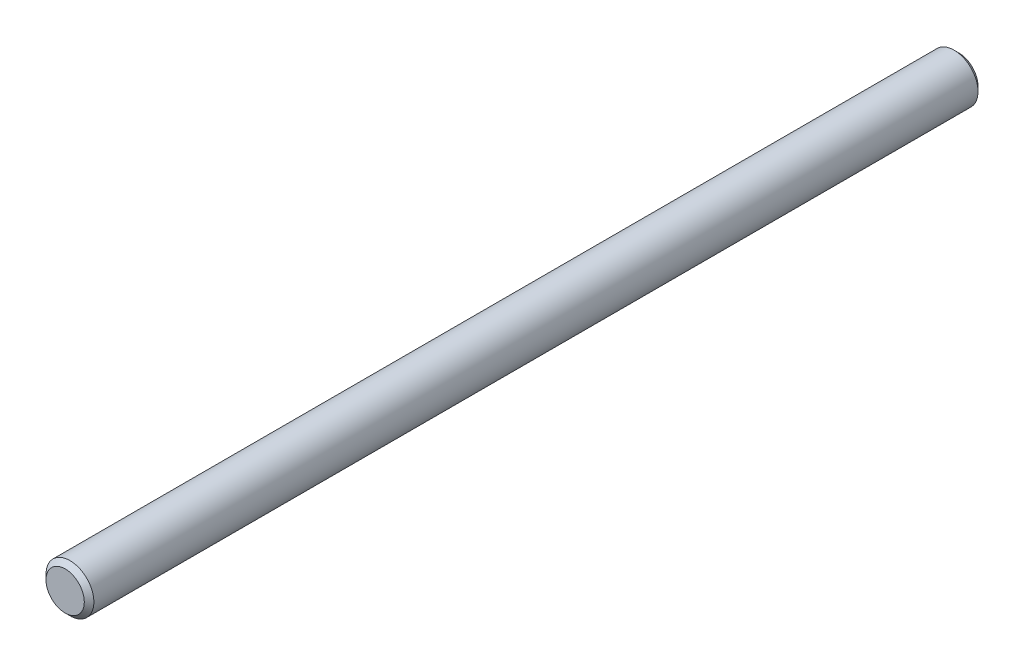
ISO-10303-21;
HEADER;
FILE_DESCRIPTION(('STEP AP214'),'2;1');
FILE_NAME('part.step','',(''),(''),'','','');
FILE_SCHEMA(('AUTOMOTIVE_DESIGN { 1 0 10303 214 1 1 1 1 }'));
ENDSEC;
DATA;
#1=APPLICATION_CONTEXT('core data for automotive mechanical design processes');
#2=APPLICATION_PROTOCOL_DEFINITION('international standard','automotive_design',2000,#1);
#3=PRODUCT_CONTEXT('',#1,'mechanical');
#4=PRODUCT('Part','Part','',(#3));
#5=PRODUCT_RELATED_PRODUCT_CATEGORY('part','',(#4));
#6=PRODUCT_DEFINITION_FORMATION('','',#4);
#7=PRODUCT_DEFINITION_CONTEXT('part definition',#1,'design');
#8=PRODUCT_DEFINITION('design','',#6,#7);
#9=PRODUCT_DEFINITION_SHAPE('','',#8);
#10=(LENGTH_UNIT() NAMED_UNIT(*) SI_UNIT(.MILLI.,.METRE.));
#11=(NAMED_UNIT(*) PLANE_ANGLE_UNIT() SI_UNIT($,.RADIAN.));
#12=(NAMED_UNIT(*) SI_UNIT($,.STERADIAN.) SOLID_ANGLE_UNIT());
#13=UNCERTAINTY_MEASURE_WITH_UNIT(LENGTH_MEASURE(1.E-05),#10,'distance_accuracy_value','');
#14=(GEOMETRIC_REPRESENTATION_CONTEXT(3) GLOBAL_UNCERTAINTY_ASSIGNED_CONTEXT((#13)) GLOBAL_UNIT_ASSIGNED_CONTEXT((#10,
#11,#12)) REPRESENTATION_CONTEXT('',''));
#15=CARTESIAN_POINT('',(0.,0.,0.));
#16=DIRECTION('',(0.,0.,1.));
#17=DIRECTION('',(1.,0.,0.));
#18=AXIS2_PLACEMENT_3D('',#15,#16,#17);
#19=CARTESIAN_POINT('',(0.,0.,56.));
#20=DIRECTION('',(0.,0.,-1.));
#21=DIRECTION('',(-1.,0.,0.));
#22=AXIS2_PLACEMENT_3D('',#19,#20,#21);
#23=CYLINDRICAL_SURFACE('',#22,1.5);
#24=CARTESIAN_POINT('',(0.,0.,0.300000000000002));
#25=DIRECTION('',(0.,0.,1.));
#26=DIRECTION('',(1.,0.,0.));
#27=AXIS2_PLACEMENT_3D('',#24,#25,#26);
#28=CIRCLE('',#27,1.5);
#29=CARTESIAN_POINT('',(1.5,0.,0.300000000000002));
#30=VERTEX_POINT('',#29);
#31=EDGE_CURVE('E39',#30,#30,#28,.T.);
#32=ORIENTED_EDGE('',*,*,#31,.T.);
#33=EDGE_LOOP('',(#32));
#34=FACE_BOUND('',#33,.T.);
#35=CARTESIAN_POINT('',(0.,0.,55.7));
#36=DIRECTION('',(0.,0.,1.));
#37=DIRECTION('',(1.,0.,0.));
#38=AXIS2_PLACEMENT_3D('',#35,#36,#37);
#39=CIRCLE('',#38,1.5);
#40=CARTESIAN_POINT('',(1.5,0.,55.7));
#41=VERTEX_POINT('',#40);
#42=EDGE_CURVE('E43',#41,#41,#39,.F.);
#43=ORIENTED_EDGE('',*,*,#42,.T.);
#44=EDGE_LOOP('',(#43));
#45=FACE_BOUND('',#44,.T.);
#46=ADVANCED_FACE('F29',(#34,#45),#23,.T.);
#47=CARTESIAN_POINT('',(0.,0.,56.));
#48=DIRECTION('',(0.,0.,1.));
#49=DIRECTION('',(1.,0.,0.));
#50=AXIS2_PLACEMENT_3D('',#47,#48,#49);
#51=PLANE('',#50);
#52=CARTESIAN_POINT('',(0.,0.,56.));
#53=DIRECTION('',(0.,0.,1.));
#54=DIRECTION('',(1.,0.,0.));
#55=AXIS2_PLACEMENT_3D('',#52,#53,#54);
#56=CIRCLE('',#55,1.2);
#57=CARTESIAN_POINT('',(1.2,0.,56.));
#58=VERTEX_POINT('',#57);
#59=EDGE_CURVE('E10',#58,#58,#56,.T.);
#60=ORIENTED_EDGE('',*,*,#59,.T.);
#61=EDGE_LOOP('',(#60));
#62=FACE_BOUND('',#61,.T.);
#63=ADVANCED_FACE('F62',(#62),#51,.T.);
#64=CARTESIAN_POINT('',(0.,0.,0.));
#65=DIRECTION('',(0.,0.,1.));
#66=DIRECTION('',(1.,0.,0.));
#67=AXIS2_PLACEMENT_3D('',#64,#65,#66);
#68=PLANE('',#67);
#69=CARTESIAN_POINT('',(0.,0.,0.));
#70=DIRECTION('',(0.,0.,1.));
#71=DIRECTION('',(1.,0.,0.));
#72=AXIS2_PLACEMENT_3D('',#69,#70,#71);
#73=CIRCLE('',#72,1.19999999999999);
#74=CARTESIAN_POINT('',(1.19999999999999,0.,0.));
#75=VERTEX_POINT('',#74);
#76=EDGE_CURVE('E35',#75,#75,#73,.F.);
#77=ORIENTED_EDGE('',*,*,#76,.T.);
#78=EDGE_LOOP('',(#77));
#79=FACE_BOUND('',#78,.T.);
#80=ADVANCED_FACE('F58',(#79),#68,.F.);
#81=CARTESIAN_POINT('',(0.,0.,0.300000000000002));
#82=DIRECTION('',(0.,0.,1.));
#83=DIRECTION('',(1.,0.,0.));
#84=AXIS2_PLACEMENT_3D('',#81,#82,#83);
#85=CONICAL_SURFACE('',#84,1.5,0.785398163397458);
#86=ORIENTED_EDGE('',*,*,#76,.F.);
#87=EDGE_LOOP('',(#86));
#88=FACE_BOUND('',#87,.T.);
#89=ORIENTED_EDGE('',*,*,#31,.F.);
#90=EDGE_LOOP('',(#89));
#91=FACE_BOUND('',#90,.T.);
#92=ADVANCED_FACE('F53',(#88,#91),#85,.T.);
#93=CARTESIAN_POINT('',(0.,0.,56.));
#94=DIRECTION('',(0.,0.,-1.));
#95=DIRECTION('',(-1.,0.,0.));
#96=AXIS2_PLACEMENT_3D('',#93,#94,#95);
#97=CONICAL_SURFACE('',#96,1.2,0.785398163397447);
#98=ORIENTED_EDGE('',*,*,#42,.F.);
#99=EDGE_LOOP('',(#98));
#100=FACE_BOUND('',#99,.T.);
#101=ORIENTED_EDGE('',*,*,#59,.F.);
#102=EDGE_LOOP('',(#101));
#103=FACE_BOUND('',#102,.T.);
#104=ADVANCED_FACE('F50',(#100,#103),#97,.T.);
#105=CLOSED_SHELL('',(#46,#63,#80,#92,#104));
#106=MANIFOLD_SOLID_BREP('B2',#105);
#107=ADVANCED_BREP_SHAPE_REPRESENTATION('',(#18,#106),#14);
#108=SHAPE_DEFINITION_REPRESENTATION(#9,#107);
ENDSEC;
END-ISO-10303-21;
